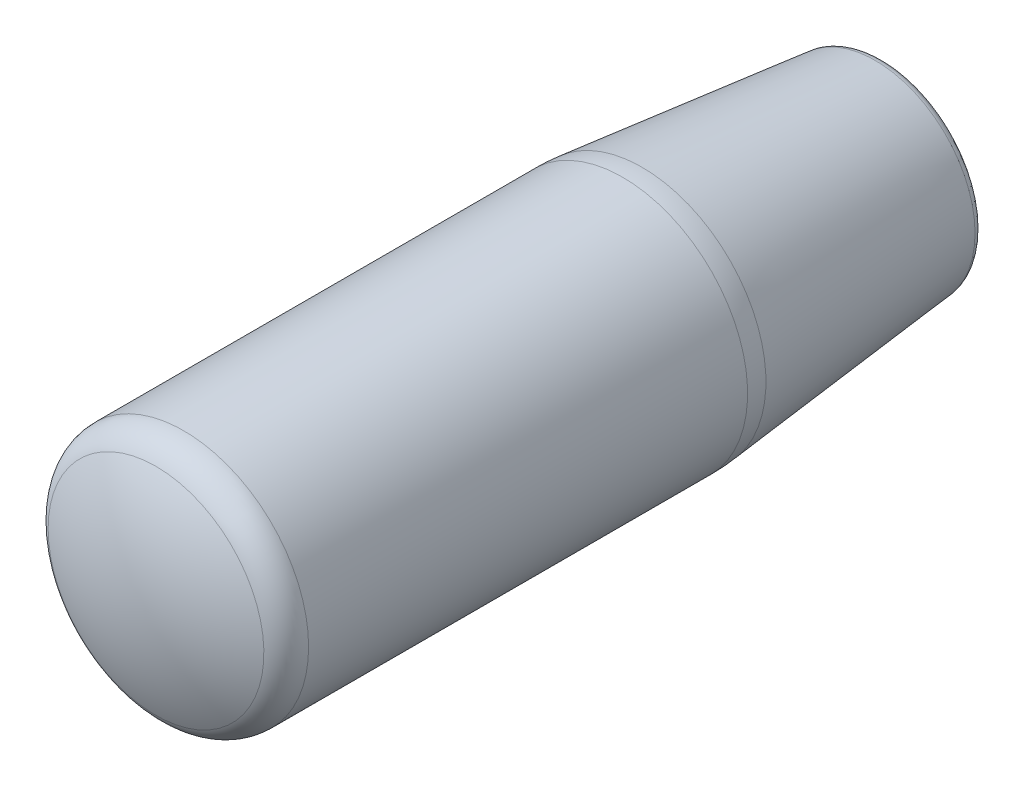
ISO-10303-21;
HEADER;
FILE_DESCRIPTION(('STEP AP214'),'2;1');
FILE_NAME('part.step','',(''),(''),'','','');
FILE_SCHEMA(('AUTOMOTIVE_DESIGN { 1 0 10303 214 1 1 1 1 }'));
ENDSEC;
DATA;
#1=APPLICATION_CONTEXT('core data for automotive mechanical design processes');
#2=APPLICATION_PROTOCOL_DEFINITION('international standard','automotive_design',2000,#1);
#3=PRODUCT_CONTEXT('',#1,'mechanical');
#4=PRODUCT('Part','Part','',(#3));
#5=PRODUCT_RELATED_PRODUCT_CATEGORY('part','',(#4));
#6=PRODUCT_DEFINITION_FORMATION('','',#4);
#7=PRODUCT_DEFINITION_CONTEXT('part definition',#1,'design');
#8=PRODUCT_DEFINITION('design','',#6,#7);
#9=PRODUCT_DEFINITION_SHAPE('','',#8);
#10=(LENGTH_UNIT() NAMED_UNIT(*) SI_UNIT(.MILLI.,.METRE.));
#11=(NAMED_UNIT(*) PLANE_ANGLE_UNIT() SI_UNIT($,.RADIAN.));
#12=(NAMED_UNIT(*) SI_UNIT($,.STERADIAN.) SOLID_ANGLE_UNIT());
#13=UNCERTAINTY_MEASURE_WITH_UNIT(LENGTH_MEASURE(1.E-05),#10,'distance_accuracy_value','');
#14=(GEOMETRIC_REPRESENTATION_CONTEXT(3) GLOBAL_UNCERTAINTY_ASSIGNED_CONTEXT((#13)) GLOBAL_UNIT_ASSIGNED_CONTEXT((#10,
#11,#12)) REPRESENTATION_CONTEXT('',''));
#15=CARTESIAN_POINT('',(0.,0.,0.));
#16=DIRECTION('',(0.,0.,1.));
#17=DIRECTION('',(1.,0.,0.));
#18=AXIS2_PLACEMENT_3D('',#15,#16,#17);
#19=CARTESIAN_POINT('',(0.,5.125,7.));
#20=DIRECTION('',(0.,0.,1.));
#21=DIRECTION('',(1.,0.,0.));
#22=AXIS2_PLACEMENT_3D('',#19,#20,#21);
#23=PLANE('',#22);
#24=CARTESIAN_POINT('',(0.,0.,7.));
#25=DIRECTION('',(0.,0.,1.));
#26=DIRECTION('',(1.,0.,0.));
#27=AXIS2_PLACEMENT_3D('',#24,#25,#26);
#28=CIRCLE('',#27,4.99999999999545);
#29=CARTESIAN_POINT('',(4.99999999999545,0.,7.));
#30=VERTEX_POINT('',#29);
#31=EDGE_CURVE('E60',#30,#30,#28,.T.);
#32=ORIENTED_EDGE('',*,*,#31,.T.);
#33=EDGE_LOOP('',(#32));
#34=FACE_BOUND('',#33,.T.);
#35=CARTESIAN_POINT('',(0.,0.,7.));
#36=DIRECTION('',(0.,0.,1.));
#37=DIRECTION('',(1.,0.,0.));
#38=AXIS2_PLACEMENT_3D('',#35,#36,#37);
#39=CIRCLE('',#38,5.25);
#40=CARTESIAN_POINT('',(5.25,0.,7.));
#41=VERTEX_POINT('',#40);
#42=EDGE_CURVE('E47',#41,#41,#39,.F.);
#43=ORIENTED_EDGE('',*,*,#42,.T.);
#44=EDGE_LOOP('',(#43));
#45=FACE_BOUND('',#44,.T.);
#46=ADVANCED_FACE('F15',(#34,#45),#23,.F.);
#47=CARTESIAN_POINT('',(0.,0.,3.5));
#48=DIRECTION('',(0.,0.,1.));
#49=DIRECTION('',(1.,0.,0.));
#50=AXIS2_PLACEMENT_3D('',#47,#48,#49);
#51=CYLINDRICAL_SURFACE('',#50,5.25);
#52=CARTESIAN_POINT('',(0.,0.,0.));
#53=DIRECTION('',(0.,0.,1.));
#54=DIRECTION('',(1.,0.,0.));
#55=AXIS2_PLACEMENT_3D('',#52,#53,#54);
#56=CIRCLE('',#55,5.25);
#57=CARTESIAN_POINT('',(5.25,0.,0.));
#58=VERTEX_POINT('',#57);
#59=EDGE_CURVE('E38',#58,#58,#56,.T.);
#60=ORIENTED_EDGE('',*,*,#59,.F.);
#61=EDGE_LOOP('',(#60));
#62=FACE_BOUND('',#61,.T.);
#63=ORIENTED_EDGE('',*,*,#42,.F.);
#64=EDGE_LOOP('',(#63));
#65=FACE_BOUND('',#64,.T.);
#66=ADVANCED_FACE('F114',(#62,#65),#51,.F.);
#67=CARTESIAN_POINT('',(0.,5.25,0.));
#68=DIRECTION('',(0.,0.,-1.));
#69=DIRECTION('',(-1.,0.,0.));
#70=AXIS2_PLACEMENT_3D('',#67,#68,#69);
#71=PLANE('',#70);
#72=CARTESIAN_POINT('',(0.,0.,0.));
#73=DIRECTION('',(0.,0.,-1.));
#74=DIRECTION('',(-1.,0.,0.));
#75=AXIS2_PLACEMENT_3D('',#72,#73,#74);
#76=CIRCLE('',#75,9.59782167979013);
#77=CARTESIAN_POINT('',(-9.59782167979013,0.,0.));
#78=VERTEX_POINT('',#77);
#79=EDGE_CURVE('E64',#78,#78,#76,.T.);
#80=ORIENTED_EDGE('',*,*,#79,.T.);
#81=EDGE_LOOP('',(#80));
#82=FACE_BOUND('',#81,.T.);
#83=ORIENTED_EDGE('',*,*,#59,.T.);
#84=EDGE_LOOP('',(#83));
#85=FACE_BOUND('',#84,.T.);
#86=ADVANCED_FACE('F30',(#82,#85),#71,.T.);
#87=CARTESIAN_POINT('',(0.,0.,54.9196428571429));
#88=DIRECTION('',(0.,0.,1.));
#89=DIRECTION('',(0.,1.,0.));
#90=AXIS2_PLACEMENT_3D('',#87,#88,#89);
#91=SPHERICAL_SURFACE('',#90,25.0803571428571);
#92=CARTESIAN_POINT('',(0.,0.,80.));
#93=VERTEX_POINT('',#92);
#94=VERTEX_LOOP('',#93);
#95=FACE_BOUND('',#94,.T.);
#96=CARTESIAN_POINT('',(0.,0.,77.2339440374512));
#97=DIRECTION('',(0.,0.,-1.));
#98=DIRECTION('',(-1.,0.,0.));
#99=AXIS2_PLACEMENT_3D('',#96,#97,#98);
#100=CIRCLE('',#99,11.4497282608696);
#101=CARTESIAN_POINT('',(-11.4497282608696,0.,77.2339440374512));
#102=VERTEX_POINT('',#101);
#103=EDGE_CURVE('E34',#102,#102,#100,.T.);
#104=ORIENTED_EDGE('',*,*,#103,.F.);
#105=EDGE_LOOP('',(#104));
#106=FACE_BOUND('',#105,.T.);
#107=ADVANCED_FACE('F26',(#95,#106),#91,.T.);
#108=CARTESIAN_POINT('',(0.,0.,26.6666666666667));
#109=DIRECTION('',(0.,0.,1.));
#110=DIRECTION('',(1.,0.,0.));
#111=AXIS2_PLACEMENT_3D('',#108,#109,#110);
#112=CONICAL_SURFACE('',#111,13.25,0.102761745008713);
#113=CARTESIAN_POINT('',(0.,0.,25.6435697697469));
#114=DIRECTION('',(0.,0.,-1.));
#115=DIRECTION('',(-1.,0.,0.));
#116=AXIS2_PLACEMENT_3D('',#113,#114,#115);
#117=CIRCLE('',#116,13.1444931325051);
#118=CARTESIAN_POINT('',(-13.1444931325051,0.,25.6435697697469));
#119=VERTEX_POINT('',#118);
#120=EDGE_CURVE('E9',#119,#119,#117,.T.);
#121=ORIENTED_EDGE('',*,*,#120,.T.);
#122=EDGE_LOOP('',(#121));
#123=FACE_BOUND('',#122,.T.);
#124=CARTESIAN_POINT('',(0.,0.,0.897419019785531));
#125=DIRECTION('',(0.,0.,-1.));
#126=DIRECTION('',(-1.,0.,0.));
#127=AXIS2_PLACEMENT_3D('',#124,#125,#126);
#128=CIRCLE('',#127,10.5925463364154);
#129=CARTESIAN_POINT('',(-10.5925463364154,0.,0.897419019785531));
#130=VERTEX_POINT('',#129);
#131=EDGE_CURVE('E44',#130,#130,#128,.F.);
#132=ORIENTED_EDGE('',*,*,#131,.T.);
#133=EDGE_LOOP('',(#132));
#134=FACE_BOUND('',#133,.T.);
#135=ADVANCED_FACE('F29',(#123,#134),#112,.T.);
#136=CARTESIAN_POINT('',(0.,0.,74.2867721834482));
#137=DIRECTION('',(0.,0.,-1.));
#138=DIRECTION('',(-1.,0.,0.));
#139=AXIS2_PLACEMENT_3D('',#136,#137,#138);
#140=TOROIDAL_SURFACE('',#139,9.9375,3.3125);
#141=ORIENTED_EDGE('',*,*,#103,.T.);
#142=EDGE_LOOP('',(#141));
#143=FACE_BOUND('',#142,.T.);
#144=CARTESIAN_POINT('',(0.,0.,74.2867721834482));
#145=DIRECTION('',(0.,0.,1.));
#146=DIRECTION('',(1.,0.,0.));
#147=AXIS2_PLACEMENT_3D('',#144,#145,#146);
#148=CIRCLE('',#147,13.25);
#149=CARTESIAN_POINT('',(13.25,0.,74.2867721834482));
#150=VERTEX_POINT('',#149);
#151=EDGE_CURVE('E37',#150,#150,#148,.F.);
#152=ORIENTED_EDGE('',*,*,#151,.F.);
#153=EDGE_LOOP('',(#152));
#154=FACE_BOUND('',#153,.T.);
#155=ADVANCED_FACE('F87',(#143,#154),#140,.T.);
#156=CARTESIAN_POINT('',(0.,0.,50.4767194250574));
#157=DIRECTION('',(0.,0.,1.));
#158=DIRECTION('',(1.,0.,0.));
#159=AXIS2_PLACEMENT_3D('',#156,#157,#158);
#160=CYLINDRICAL_SURFACE('',#159,13.25);
#161=CARTESIAN_POINT('',(0.,0.,27.6951893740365));
#162=DIRECTION('',(0.,0.,-1.));
#163=DIRECTION('',(-1.,0.,0.));
#164=AXIS2_PLACEMENT_3D('',#161,#162,#163);
#165=CIRCLE('',#164,13.25);
#166=CARTESIAN_POINT('',(-13.25,0.,27.6951893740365));
#167=VERTEX_POINT('',#166);
#168=EDGE_CURVE('E23',#167,#167,#165,.F.);
#169=ORIENTED_EDGE('',*,*,#168,.T.);
#170=EDGE_LOOP('',(#169));
#171=FACE_BOUND('',#170,.T.);
#172=ORIENTED_EDGE('',*,*,#151,.T.);
#173=EDGE_LOOP('',(#172));
#174=FACE_BOUND('',#173,.T.);
#175=ADVANCED_FACE('F71',(#171,#174),#160,.T.);
#176=CARTESIAN_POINT('',(0.,0.,55.));
#177=DIRECTION('',(0.,0.,-1.));
#178=DIRECTION('',(-1.,0.,0.));
#179=AXIS2_PLACEMENT_3D('',#176,#177,#178);
#180=CYLINDRICAL_SURFACE('',#179,4.99999999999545);
#181=CARTESIAN_POINT('',(0.,0.,55.));
#182=DIRECTION('',(0.,0.,-1.));
#183=DIRECTION('',(-1.,0.,0.));
#184=AXIS2_PLACEMENT_3D('',#181,#182,#183);
#185=CIRCLE('',#184,4.99999999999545);
#186=CARTESIAN_POINT('',(-4.99999999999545,0.,55.));
#187=VERTEX_POINT('',#186);
#188=EDGE_CURVE('E104',#187,#187,#185,.T.);
#189=ORIENTED_EDGE('',*,*,#188,.F.);
#190=EDGE_LOOP('',(#189));
#191=FACE_BOUND('',#190,.T.);
#192=ORIENTED_EDGE('',*,*,#31,.F.);
#193=EDGE_LOOP('',(#192));
#194=FACE_BOUND('',#193,.T.);
#195=ADVANCED_FACE('F86',(#191,#194),#180,.F.);
#196=CARTESIAN_POINT('',(0.,0.,55.));
#197=DIRECTION('',(0.,0.,-1.));
#198=DIRECTION('',(-1.,0.,0.));
#199=AXIS2_PLACEMENT_3D('',#196,#197,#198);
#200=PLANE('',#199);
#201=ORIENTED_EDGE('',*,*,#188,.T.);
#202=EDGE_LOOP('',(#201));
#203=FACE_BOUND('',#202,.T.);
#204=ADVANCED_FACE('F82',(#203),#200,.T.);
#205=CARTESIAN_POINT('',(0.,0.,1.));
#206=DIRECTION('',(0.,0.,-1.));
#207=DIRECTION('',(-1.,0.,0.));
#208=AXIS2_PLACEMENT_3D('',#205,#206,#207);
#209=TOROIDAL_SURFACE('',#208,9.59782167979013,1.);
#210=ORIENTED_EDGE('',*,*,#79,.F.);
#211=EDGE_LOOP('',(#210));
#212=FACE_BOUND('',#211,.T.);
#213=ORIENTED_EDGE('',*,*,#131,.F.);
#214=EDGE_LOOP('',(#213));
#215=FACE_BOUND('',#214,.T.);
#216=ADVANCED_FACE('F75',(#212,#215),#209,.T.);
#217=CARTESIAN_POINT('',(0.,0.,27.6951893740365));
#218=DIRECTION('',(0.,0.,-1.));
#219=DIRECTION('',(-1.,0.,0.));
#220=AXIS2_PLACEMENT_3D('',#217,#218,#219);
#221=DEGENERATE_TOROIDAL_SURFACE('',#220,6.75,20.,.F.);
#222=ORIENTED_EDGE('',*,*,#120,.F.);
#223=EDGE_LOOP('',(#222));
#224=FACE_BOUND('',#223,.T.);
#225=ORIENTED_EDGE('',*,*,#168,.F.);
#226=EDGE_LOOP('',(#225));
#227=FACE_BOUND('',#226,.T.);
#228=ADVANCED_FACE('F17',(#224,#227),#221,.F.);
#229=CLOSED_SHELL('',(#46,#66,#86,#107,#135,#155,#175,#195,#204,#216,#228));
#230=MANIFOLD_SOLID_BREP('B1',#229);
#231=ADVANCED_BREP_SHAPE_REPRESENTATION('',(#18,#230),#14);
#232=SHAPE_DEFINITION_REPRESENTATION(#9,#231);
ENDSEC;
END-ISO-10303-21;
